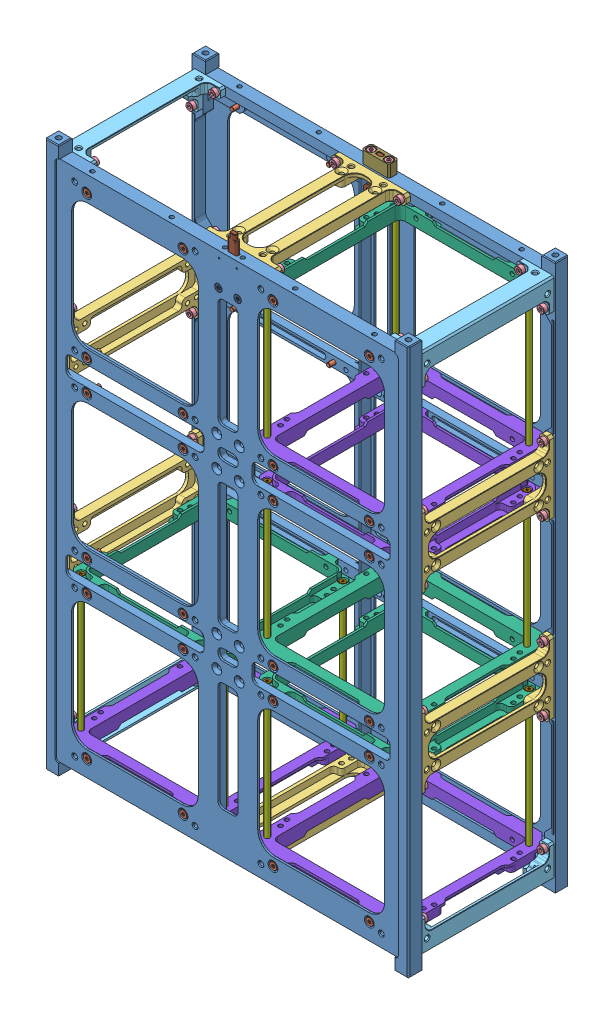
SolidWorks assembly sts-x-6u-cust-ship_asm1.SLDASM, configuration Default (file format 7000). Lengths in mm.
Overall size (226.3 343.75 100).
181 component instances, 12 part files, 0 mates.
Components (placement in the parent):
- SIDE-FRAME-ASM_ASM_1-1: SIDE-FRAME-ASM_ASM_1.sldasm [Default] at (156.4493 196.3138 -10) size (226.3 340.5 9)
  - ISIS-STSX-1-1-001-SIDE-FRAME-RE_1-1: ISIS-STSX-1-1-001-SIDE-FRAME-RE_1.sldprt [Default] at origin size (226.3 340.5 9)
  - M2-5X8_CSK_TORX_1-1: M2-5X8_CSK_TORX_1.sldprt [Default] at (88 -152.5 1.1) x (-1 0 0) z (0 1 0) size (4.7 8 4.7)
  - M2-5X8_CSK_TORX_1-2: M2-5X8_CSK_TORX_1.sldprt [Default] at (28 -152.5 1.1) x (-1 0 0) z (0 1 0) size (4.7 8 4.7)
  - M2-5X8_CSK_TORX_1-3: M2-5X8_CSK_TORX_1.sldprt [Default] at (-28 -152.5 1.1) x (-1 0 0) z (0 1 0) size (4.7 8 4.7)
  - M2-5X8_CSK_TORX_1-4: M2-5X8_CSK_TORX_1.sldprt [Default] at (-88 -152.5 1.1) x (-1 0 0) z (0 1 0) size (4.7 8 4.7)
  - M2-5X8_CSK_TORX_1-5: M2-5X8_CSK_TORX_1.sldprt [Default] at (88 -63.5 1.1) x (-1 0 0) z (0 1 0) size (4.7 8 4.7)
  - M2-5X8_CSK_TORX_1-6: M2-5X8_CSK_TORX_1.sldprt [Default] at (28 -63.5 1.1) x (-1 0 0) z (0 1 0) size (4.7 8 4.7)
  - M2-5X8_CSK_TORX_1-7: M2-5X8_CSK_TORX_1.sldprt [Default] at (-28 -63.5 1.1) x (-1 0 0) z (0 1 0) size (4.7 8 4.7)
  - M2-5X8_CSK_TORX_1-8: M2-5X8_CSK_TORX_1.sldprt [Default] at (-88 -63.5 1.1) x (-1 0 0) z (0 1 0) size (4.7 8 4.7)
  - M2-5X8_CSK_TORX_1-9: M2-5X8_CSK_TORX_1.sldprt [Default] at (88 -44.5 1.1) x (-1 0 0) z (0 1 0) size (4.7 8 4.7)
  - M2-5X8_CSK_TORX_1-10: M2-5X8_CSK_TORX_1.sldprt [Default] at (28 -44.5 1.1) x (-1 0 0) z (0 1 0) size (4.7 8 4.7)
  - M2-5X8_CSK_TORX_1-11: M2-5X8_CSK_TORX_1.sldprt [Default] at (-28 -44.5 1.1) x (-1 0 0) z (0 1 0) size (4.7 8 4.7)
  - M2-5X8_CSK_TORX_1-12: M2-5X8_CSK_TORX_1.sldprt [Default] at (-88 -44.5 1.1) x (-1 0 0) z (0 1 0) size (4.7 8 4.7)
  - M2-5X8_CSK_TORX_1-13: M2-5X8_CSK_TORX_1.sldprt [Default] at (88 44.5 1.1) x (-1 0 0) z (0 1 0) size (4.7 8 4.7)
  - M2-5X8_CSK_TORX_1-14: M2-5X8_CSK_TORX_1.sldprt [Default] at (28 44.5 1.1) x (-1 0 0) z (0 1 0) size (4.7 8 4.7)
  - M2-5X8_CSK_TORX_1-15: M2-5X8_CSK_TORX_1.sldprt [Default] at (-28 44.5 1.1) x (-1 0 0) z (0 1 0) size (4.7 8 4.7)
  - M2-5X8_CSK_TORX_1-16: M2-5X8_CSK_TORX_1.sldprt [Default] at (-88 44.5 1.1) x (-1 0 0) z (0 1 0) size (4.7 8 4.7)
  - M2-5X8_CSK_TORX_1-17: M2-5X8_CSK_TORX_1.sldprt [Default] at (88 63.5 1.1) x (-1 0 0) z (0 1 0) size (4.7 8 4.7)
  - M2-5X8_CSK_TORX_1-18: M2-5X8_CSK_TORX_1.sldprt [Default] at (28 63.5 1.1) x (-1 0 0) z (0 1 0) size (4.7 8 4.7)
  - M2-5X8_CSK_TORX_1-19: M2-5X8_CSK_TORX_1.sldprt [Default] at (-28 63.5 1.1) x (-1 0 0) z (0 1 0) size (4.7 8 4.7)
  - M2-5X8_CSK_TORX_1-20: M2-5X8_CSK_TORX_1.sldprt [Default] at (-88 63.5 1.1) x (-1 0 0) z (0 1 0) size (4.7 8 4.7)
  - M2-5X8_CSK_TORX_1-21: M2-5X8_CSK_TORX_1.sldprt [Default] at (88 152.5 1.1) x (-1 0 0) z (0 1 0) size (4.7 8 4.7)
  - M2-5X8_CSK_TORX_1-22: M2-5X8_CSK_TORX_1.sldprt [Default] at (28 152.5 1.1) x (-1 0 0) z (0 1 0) size (4.7 8 4.7)
  - M2-5X8_CSK_TORX_1-23: M2-5X8_CSK_TORX_1.sldprt [Default] at (-28 152.5 1.1) x (-1 0 0) z (0 1 0) size (4.7 8 4.7)
  - M2-5X8_CSK_TORX_1-24: M2-5X8_CSK_TORX_1.sldprt [Default] at (-88 152.5 1.1) x (-1 0 0) z (0 1 0) size (4.7 8 4.7)
- BRACKET-1-ASM_ASM_1-1: BRACKET-1-ASM_ASM_1.sldasm [Default] at (262.7993 156.3138 -8.5) x (0 -1 0) z (1 0 0) size (46 93 6.01)
  - ISIS-STSX-1-1-002-STRUCTURAL-BR-1: ISIS-STSX-1-1-002-STRUCTURAL-BR.sldprt [Default] at origin size (46 89 6.01)
  - M2-5X8_HEX_1-1: M2-5X8_HEX_1.sldprt [Default] at (34 -5 3) size (4.51 10.5 4.52)
  - M2-5X8_HEX_1-2: M2-5X8_HEX_1.sldprt [Default] at (-6 -5 3) size (4.51 10.5 4.52)
  - M2-5X8_HEX_1-3: M2-5X8_HEX_1.sldprt [Default] at (34 88 3) x (-1 0 0) z (0 0 1) size (4.51 10.5 4.52)
  - M2-5X8_HEX_1-4: M2-5X8_HEX_1.sldprt [Default] at (-6 88 3) x (-1 0 0) z (0 0 1) size (4.51 10.5 4.52)
- BRACKET-1-ASM_ASM_1-2: BRACKET-1-ASM_ASM_1.sldasm [Default] at (262.7993 236.3138 -91.5) x (0 1 0) z (1 0 0) size (46 93 6.01)
  - ISIS-STSX-1-1-002-STRUCTURAL-BR-1: ISIS-STSX-1-1-002-STRUCTURAL-BR.sldprt [Default] at origin size (46 89 6.01)
  - M2-5X8_HEX_1-1: M2-5X8_HEX_1.sldprt [Default] at (34 -5 3) size (4.51 10.5 4.52)
  - M2-5X8_HEX_1-2: M2-5X8_HEX_1.sldprt [Default] at (-6 -5 3) size (4.51 10.5 4.52)
  - M2-5X8_HEX_1-3: M2-5X8_HEX_1.sldprt [Default] at (34 88 3) x (-1 0 0) z (0 0 1) size (4.51 10.5 4.52)
  - M2-5X8_HEX_1-4: M2-5X8_HEX_1.sldprt [Default] at (-6 88 3) x (-1 0 0) z (0 0 1) size (4.51 10.5 4.52)
- BRACKET-1-ASM_ASM_1-3: BRACKET-1-ASM_ASM_1.sldasm [Default] at (50.0993 156.3138 -91.5) x (0 -1 0) z (-1 0 0) size (46 93 6.01)
  - ISIS-STSX-1-1-002-STRUCTURAL-BR-1: ISIS-STSX-1-1-002-STRUCTURAL-BR.sldprt [Default] at origin size (46 89 6.01)
  - M2-5X8_HEX_1-1: M2-5X8_HEX_1.sldprt [Default] at (34 -5 3) size (4.51 10.5 4.52)
  - M2-5X8_HEX_1-2: M2-5X8_HEX_1.sldprt [Default] at (-6 -5 3) size (4.51 10.5 4.52)
  - M2-5X8_HEX_1-3: M2-5X8_HEX_1.sldprt [Default] at (34 88 3) x (-1 0 0) z (0 0 1) size (4.51 10.5 4.52)
  - M2-5X8_HEX_1-4: M2-5X8_HEX_1.sldprt [Default] at (-6 88 3) x (-1 0 0) z (0 0 1) size (4.51 10.5 4.52)
- BRACKET-1-ASM_ASM_1-4: BRACKET-1-ASM_ASM_1.sldasm [Default] at (50.0993 264.3138 -91.5) x (0 -1 0) z (-1 0 0) size (46 93 6.01)
  - ISIS-STSX-1-1-002-STRUCTURAL-BR-1: ISIS-STSX-1-1-002-STRUCTURAL-BR.sldprt [Default] at origin size (46 89 6.01)
  - M2-5X8_HEX_1-1: M2-5X8_HEX_1.sldprt [Default] at (34 -5 3) size (4.51 10.5 4.52)
  - M2-5X8_HEX_1-2: M2-5X8_HEX_1.sldprt [Default] at (-6 -5 3) size (4.51 10.5 4.52)
  - M2-5X8_HEX_1-3: M2-5X8_HEX_1.sldprt [Default] at (34 88 3) x (-1 0 0) z (0 0 1) size (4.51 10.5 4.52)
  - M2-5X8_HEX_1-4: M2-5X8_HEX_1.sldprt [Default] at (-6 88 3) x (-1 0 0) z (0 0 1) size (4.51 10.5 4.52)
- BRACKET-2-ASM_ASM_1-1: BRACKET-2-ASM_ASM_1.sldasm [Default] at (44.0993 359.0138 -91.5) x (0 -1 0) z (0 0 1) size (20 20 93)
  - ISIS-STSX-1-1-003-STRUCTURAL-BR_1-1: ISIS-STSX-1-1-003-STRUCTURAL-BR_1.sldprt [Default] at origin size (20 20 89)
  - M2-5X8_HEX_1-1: M2-5X8_HEX_1.sldprt [Default] at (17 3 88) x (1 0 0) z (0 1 0) size (4.51 10.5 4.52)
  - M2-5X8_HEX_1-2: M2-5X8_HEX_1.sldprt [Default] at (3 17 88) x (1 0 0) z (0 1 0) size (4.51 10.5 4.52)
  - M2-5X8_HEX_1-3: M2-5X8_HEX_1.sldprt [Default] at (17 3 -5) x (-1 0 0) z (0 1 0) size (4.51 10.5 4.52)
  - M2-5X8_HEX_1-4: M2-5X8_HEX_1.sldprt [Default] at (3 17 -5) x (-1 0 0) z (0 1 0) size (4.51 10.5 4.52)
- BRACKET-2-ASM_ASM_1-2: BRACKET-2-ASM_ASM_1.sldasm [Default] at (268.7993 359.0138 -91.5) x (-1 0 0) z (0 0 1) size (20 20 93)
  - ISIS-STSX-1-1-003-STRUCTURAL-BR_1-1: ISIS-STSX-1-1-003-STRUCTURAL-BR_1.sldprt [Default] at origin size (20 20 89)
  - M2-5X8_HEX_1-1: M2-5X8_HEX_1.sldprt [Default] at (17 3 88) x (1 0 0) z (0 1 0) size (4.51 10.5 4.52)
  - M2-5X8_HEX_1-2: M2-5X8_HEX_1.sldprt [Default] at (3 17 88) x (1 0 0) z (0 1 0) size (4.51 10.5 4.52)
  - M2-5X8_HEX_1-3: M2-5X8_HEX_1.sldprt [Default] at (17 3 -5) x (-1 0 0) z (0 1 0) size (4.51 10.5 4.52)
  - M2-5X8_HEX_1-4: M2-5X8_HEX_1.sldprt [Default] at (3 17 -5) x (-1 0 0) z (0 1 0) size (4.51 10.5 4.52)
- BRACKET-2-ASM_ASM_1-3: BRACKET-2-ASM_ASM_1.sldasm [Default] at (44.0993 33.6138 -91.5) size (20 20 93)
  - ISIS-STSX-1-1-003-STRUCTURAL-BR_1-1: ISIS-STSX-1-1-003-STRUCTURAL-BR_1.sldprt [Default] at origin size (20 20 89)
  - M2-5X8_HEX_1-1: M2-5X8_HEX_1.sldprt [Default] at (17 3 88) x (1 0 0) z (0 1 0) size (4.51 10.5 4.52)
  - M2-5X8_HEX_1-2: M2-5X8_HEX_1.sldprt [Default] at (3 17 88) x (1 0 0) z (0 1 0) size (4.51 10.5 4.52)
  - M2-5X8_HEX_1-3: M2-5X8_HEX_1.sldprt [Default] at (17 3 -5) x (-1 0 0) z (0 1 0) size (4.51 10.5 4.52)
  - M2-5X8_HEX_1-4: M2-5X8_HEX_1.sldprt [Default] at (3 17 -5) x (-1 0 0) z (0 1 0) size (4.51 10.5 4.52)
- BRACKET-2-ASM_ASM_1-4: BRACKET-2-ASM_ASM_1.sldasm [Default] at (268.7993 33.6138 -91.5) x (0 1 0) z (0 0 1) size (20 20 93)
  - ISIS-STSX-1-1-003-STRUCTURAL-BR_1-1: ISIS-STSX-1-1-003-STRUCTURAL-BR_1.sldprt [Default] at origin size (20 20 89)
  - M2-5X8_HEX_1-1: M2-5X8_HEX_1.sldprt [Default] at (17 3 88) x (1 0 0) z (0 1 0) size (4.51 10.5 4.52)
  - M2-5X8_HEX_1-2: M2-5X8_HEX_1.sldprt [Default] at (3 17 88) x (1 0 0) z (0 1 0) size (4.51 10.5 4.52)
  - M2-5X8_HEX_1-3: M2-5X8_HEX_1.sldprt [Default] at (17 3 -5) x (-1 0 0) z (0 1 0) size (4.51 10.5 4.52)
  - M2-5X8_HEX_1-4: M2-5X8_HEX_1.sldprt [Default] at (3 17 -5) x (-1 0 0) z (0 1 0) size (4.51 10.5 4.52)
- BRACKET-1-ASM_ASM_1-5: BRACKET-1-ASM_ASM_1.sldasm [Default] at (170.4493 39.6138 -8.5) x (-1 0 0) z (0 -1 0) size (46 93 6.01)
  - ISIS-STSX-1-1-002-STRUCTURAL-BR-1: ISIS-STSX-1-1-002-STRUCTURAL-BR.sldprt [Default] at origin size (46 89 6.01)
  - M2-5X8_HEX_1-1: M2-5X8_HEX_1.sldprt [Default] at (34 -5 3) size (4.51 10.5 4.52)
  - M2-5X8_HEX_1-2: M2-5X8_HEX_1.sldprt [Default] at (-6 -5 3) size (4.51 10.5 4.52)
  - M2-5X8_HEX_1-3: M2-5X8_HEX_1.sldprt [Default] at (34 88 3) x (-1 0 0) z (0 0 1) size (4.51 10.5 4.52)
  - M2-5X8_HEX_1-4: M2-5X8_HEX_1.sldprt [Default] at (-6 88 3) x (-1 0 0) z (0 0 1) size (4.51 10.5 4.52)
- BRACKET-1-ASM_ASM_1-6: BRACKET-1-ASM_ASM_1.sldasm [Default] at (142.4493 353.0138 -8.5) x (1 0 0) z (0 1 0) size (46 93 6.01)
  - ISIS-STSX-1-1-002-STRUCTURAL-BR-1: ISIS-STSX-1-1-002-STRUCTURAL-BR.sldprt [Default] at origin size (46 89 6.01)
  - M2-5X8_HEX_1-1: M2-5X8_HEX_1.sldprt [Default] at (34 -5 3) size (4.51 10.5 4.52)
  - M2-5X8_HEX_1-2: M2-5X8_HEX_1.sldprt [Default] at (-6 -5 3) size (4.51 10.5 4.52)
  - M2-5X8_HEX_1-3: M2-5X8_HEX_1.sldprt [Default] at (34 88 3) x (-1 0 0) z (0 0 1) size (4.51 10.5 4.52)
  - M2-5X8_HEX_1-4: M2-5X8_HEX_1.sldprt [Default] at (-6 88 3) x (-1 0 0) z (0 0 1) size (4.51 10.5 4.52)
- SIDE-FRAME-ASM_ASM_1-2: SIDE-FRAME-ASM_ASM_1.sldasm [Default] at (156.4493 196.3138 -90) x (-1 0 0) z (0 0 -1) size (226.3 340.5 9)
  - ISIS-STSX-1-1-001-SIDE-FRAME-RE_1-1: ISIS-STSX-1-1-001-SIDE-FRAME-RE_1.sldprt [Default] at origin size (226.3 340.5 9)
  - M2-5X8_CSK_TORX_1-1: M2-5X8_CSK_TORX_1.sldprt [Default] at (88 -152.5 1.1) x (-1 0 0) z (0 1 0) size (4.7 8 4.7)
  - M2-5X8_CSK_TORX_1-2: M2-5X8_CSK_TORX_1.sldprt [Default] at (28 -152.5 1.1) x (-1 0 0) z (0 1 0) size (4.7 8 4.7)
  - M2-5X8_CSK_TORX_1-3: M2-5X8_CSK_TORX_1.sldprt [Default] at (-28 -152.5 1.1) x (-1 0 0) z (0 1 0) size (4.7 8 4.7)
  - M2-5X8_CSK_TORX_1-4: M2-5X8_CSK_TORX_1.sldprt [Default] at (-88 -152.5 1.1) x (-1 0 0) z (0 1 0) size (4.7 8 4.7)
  - M2-5X8_CSK_TORX_1-5: M2-5X8_CSK_TORX_1.sldprt [Default] at (88 -63.5 1.1) x (-1 0 0) z (0 1 0) size (4.7 8 4.7)
  - M2-5X8_CSK_TORX_1-6: M2-5X8_CSK_TORX_1.sldprt [Default] at (28 -63.5 1.1) x (-1 0 0) z (0 1 0) size (4.7 8 4.7)
  - M2-5X8_CSK_TORX_1-7: M2-5X8_CSK_TORX_1.sldprt [Default] at (-28 -63.5 1.1) x (-1 0 0) z (0 1 0) size (4.7 8 4.7)
  - M2-5X8_CSK_TORX_1-8: M2-5X8_CSK_TORX_1.sldprt [Default] at (-88 -63.5 1.1) x (-1 0 0) z (0 1 0) size (4.7 8 4.7)
  - M2-5X8_CSK_TORX_1-9: M2-5X8_CSK_TORX_1.sldprt [Default] at (88 -44.5 1.1) x (-1 0 0) z (0 1 0) size (4.7 8 4.7)
  - M2-5X8_CSK_TORX_1-10: M2-5X8_CSK_TORX_1.sldprt [Default] at (28 -44.5 1.1) x (-1 0 0) z (0 1 0) size (4.7 8 4.7)
  - M2-5X8_CSK_TORX_1-11: M2-5X8_CSK_TORX_1.sldprt [Default] at (-28 -44.5 1.1) x (-1 0 0) z (0 1 0) size (4.7 8 4.7)
  - M2-5X8_CSK_TORX_1-12: M2-5X8_CSK_TORX_1.sldprt [Default] at (-88 -44.5 1.1) x (-1 0 0) z (0 1 0) size (4.7 8 4.7)
  - M2-5X8_CSK_TORX_1-13: M2-5X8_CSK_TORX_1.sldprt [Default] at (88 44.5 1.1) x (-1 0 0) z (0 1 0) size (4.7 8 4.7)
  - M2-5X8_CSK_TORX_1-14: M2-5X8_CSK_TORX_1.sldprt [Default] at (28 44.5 1.1) x (-1 0 0) z (0 1 0) size (4.7 8 4.7)
  - M2-5X8_CSK_TORX_1-15: M2-5X8_CSK_TORX_1.sldprt [Default] at (-28 44.5 1.1) x (-1 0 0) z (0 1 0) size (4.7 8 4.7)
  - M2-5X8_CSK_TORX_1-16: M2-5X8_CSK_TORX_1.sldprt [Default] at (-88 44.5 1.1) x (-1 0 0) z (0 1 0) size (4.7 8 4.7)
  - M2-5X8_CSK_TORX_1-17: M2-5X8_CSK_TORX_1.sldprt [Default] at (88 63.5 1.1) x (-1 0 0) z (0 1 0) size (4.7 8 4.7)
  - M2-5X8_CSK_TORX_1-18: M2-5X8_CSK_TORX_1.sldprt [Default] at (28 63.5 1.1) x (-1 0 0) z (0 1 0) size (4.7 8 4.7)
  - M2-5X8_CSK_TORX_1-19: M2-5X8_CSK_TORX_1.sldprt [Default] at (-28 63.5 1.1) x (-1 0 0) z (0 1 0) size (4.7 8 4.7)
  - M2-5X8_CSK_TORX_1-20: M2-5X8_CSK_TORX_1.sldprt [Default] at (-88 63.5 1.1) x (-1 0 0) z (0 1 0) size (4.7 8 4.7)
  - M2-5X8_CSK_TORX_1-21: M2-5X8_CSK_TORX_1.sldprt [Default] at (88 152.5 1.1) x (-1 0 0) z (0 1 0) size (4.7 8 4.7)
  - M2-5X8_CSK_TORX_1-22: M2-5X8_CSK_TORX_1.sldprt [Default] at (28 152.5 1.1) x (-1 0 0) z (0 1 0) size (4.7 8 4.7)
  - M2-5X8_CSK_TORX_1-23: M2-5X8_CSK_TORX_1.sldprt [Default] at (-28 152.5 1.1) x (-1 0 0) z (0 1 0) size (4.7 8 4.7)
  - M2-5X8_CSK_TORX_1-24: M2-5X8_CSK_TORX_1.sldprt [Default] at (-88 152.5 1.1) x (-1 0 0) z (0 1 0) size (4.7 8 4.7)
- STACK-FRAME_ASM_1-1: STACK-FRAME_ASM_1.sldasm [Default] at (214.4493 136.3138 -50) x (1 0 0) z (0 -1 0) size (95.83 95.82 95.81)
  - ISIS-STSX-1-2-001-STACK-FRAME-A_1-1: ISIS-STSX-1-2-001-STACK-FRAME-A_1.sldprt [Default] at origin size (95.83 95.82 8.41)
  - ISIS-STSX-1-2-003-STACK-ROD-1U-_1-1: ISIS-STSX-1-2-003-STACK-ROD-1U-_1.sldprt [Default] at (-42.8 39.95 5.5) size (3.1 3.1 85)
  - ISIS-STSX-1-2-003-STACK-ROD-1U-_1-2: ISIS-STSX-1-2-003-STACK-ROD-1U-_1.sldprt [Default] at (42.9 36.15 5.5) size (3.1 3.1 85)
  - ISIS-STSX-1-2-003-STACK-ROD-1U-_1-3: ISIS-STSX-1-2-003-STACK-ROD-1U-_1.sldprt [Default] at (42.9 -37.45 5.5) size (3.1 3.1 85)
  - ISIS-STSX-1-2-003-STACK-ROD-1U-_1-4: ISIS-STSX-1-2-003-STACK-ROD-1U-_1.sldprt [Default] at (-42.8 -39.95 5.5) size (3.1 3.1 85)
  - ISIS-STSX-1-2-002-STACK-FRAME-B_1-1: ISIS-STSX-1-2-002-STACK-FRAME-B_1.sldprt [Default] at (0 0 96) x (1 0 0) z (0 0 -1) size (95.83 95.82 8.41)
  - M2-0X6_CSK_TORX_1-1: M2-0X6_CSK_TORX_1.sldprt [Default] at (42.9 -37.45 86.4) x (-1 0 0) z (0 1 0) size (3.8 6 3.8)
  - M2-0X6_CSK_TORX_1-2: M2-0X6_CSK_TORX_1.sldprt [Default] at (42.9 36.15 86.4) x (-1 0 0) z (0 1 0) size (3.8 6 3.8)
  - M2-0X6_CSK_TORX_1-3: M2-0X6_CSK_TORX_1.sldprt [Default] at (-42.8 -39.95 86.4) x (-1 0 0) z (0 1 0) size (3.8 6 3.8)
  - M2-0X6_CSK_TORX_1-4: M2-0X6_CSK_TORX_1.sldprt [Default] at (-42.8 39.95 86.4) x (-1 0 0) z (0 1 0) size (3.8 6 3.8)
  - M2-0X6_CSK_TORX_1-5: M2-0X6_CSK_TORX_1.sldprt [Default] at (42.9 -37.45 9.6) x (1 0 0) z (0 1 0) size (3.8 6 3.8)
  - M2-0X6_CSK_TORX_1-6: M2-0X6_CSK_TORX_1.sldprt [Default] at (42.9 36.15 9.6) x (1 0 0) z (0 1 0) size (3.8 6 3.8)
  - M2-0X6_CSK_TORX_1-7: M2-0X6_CSK_TORX_1.sldprt [Default] at (-42.8 -39.95 9.6) x (1 0 0) z (0 1 0) size (3.8 6 3.8)
  - M2-0X6_CSK_TORX_1-8: M2-0X6_CSK_TORX_1.sldprt [Default] at (-42.8 39.95 9.6) x (1 0 0) z (0 1 0) size (3.8 6 3.8)
- STACK-FRAME_ASM_1-2: STACK-FRAME_ASM_1.sldasm [Default] at (214.4493 148.3138 -50) x (1 0 0) z (0 1 0) size (95.83 95.82 95.81)
  - ISIS-STSX-1-2-001-STACK-FRAME-A_1-1: ISIS-STSX-1-2-001-STACK-FRAME-A_1.sldprt [Default] at origin size (95.83 95.82 8.41)
  - ISIS-STSX-1-2-003-STACK-ROD-1U-_1-1: ISIS-STSX-1-2-003-STACK-ROD-1U-_1.sldprt [Default] at (-42.8 39.95 5.5) size (3.1 3.1 85)
  - ISIS-STSX-1-2-003-STACK-ROD-1U-_1-2: ISIS-STSX-1-2-003-STACK-ROD-1U-_1.sldprt [Default] at (42.9 36.15 5.5) size (3.1 3.1 85)
  - ISIS-STSX-1-2-003-STACK-ROD-1U-_1-3: ISIS-STSX-1-2-003-STACK-ROD-1U-_1.sldprt [Default] at (42.9 -37.45 5.5) size (3.1 3.1 85)
  - ISIS-STSX-1-2-003-STACK-ROD-1U-_1-4: ISIS-STSX-1-2-003-STACK-ROD-1U-_1.sldprt [Default] at (-42.8 -39.95 5.5) size (3.1 3.1 85)
  - ISIS-STSX-1-2-002-STACK-FRAME-B_1-1: ISIS-STSX-1-2-002-STACK-FRAME-B_1.sldprt [Default] at (0 0 96) x (1 0 0) z (0 0 -1) size (95.83 95.82 8.41)
  - M2-0X6_CSK_TORX_1-1: M2-0X6_CSK_TORX_1.sldprt [Default] at (42.9 -37.45 86.4) x (-1 0 0) z (0 1 0) size (3.8 6 3.8)
  - M2-0X6_CSK_TORX_1-2: M2-0X6_CSK_TORX_1.sldprt [Default] at (42.9 36.15 86.4) x (-1 0 0) z (0 1 0) size (3.8 6 3.8)
  - M2-0X6_CSK_TORX_1-3: M2-0X6_CSK_TORX_1.sldprt [Default] at (-42.8 -39.95 86.4) x (-1 0 0) z (0 1 0) size (3.8 6 3.8)
  - M2-0X6_CSK_TORX_1-4: M2-0X6_CSK_TORX_1.sldprt [Default] at (-42.8 39.95 86.4) x (-1 0 0) z (0 1 0) size (3.8 6 3.8)
  - M2-0X6_CSK_TORX_1-5: M2-0X6_CSK_TORX_1.sldprt [Default] at (42.9 -37.45 9.6) x (1 0 0) z (0 1 0) size (3.8 6 3.8)
  - M2-0X6_CSK_TORX_1-6: M2-0X6_CSK_TORX_1.sldprt [Default] at (42.9 36.15 9.6) x (1 0 0) z (0 1 0) size (3.8 6 3.8)
  - M2-0X6_CSK_TORX_1-7: M2-0X6_CSK_TORX_1.sldprt [Default] at (-42.8 -39.95 9.6) x (1 0 0) z (0 1 0) size (3.8 6 3.8)
  - M2-0X6_CSK_TORX_1-8: M2-0X6_CSK_TORX_1.sldprt [Default] at (-42.8 39.95 9.6) x (1 0 0) z (0 1 0) size (3.8 6 3.8)
- STACK-FRAME_ASM_1-3: STACK-FRAME_ASM_1.sldasm [Default] at (214.4493 352.3138 -50) x (1 0 0) z (0 -1 0) size (95.83 95.82 95.81)
  - ISIS-STSX-1-2-001-STACK-FRAME-A_1-1: ISIS-STSX-1-2-001-STACK-FRAME-A_1.sldprt [Default] at origin size (95.83 95.82 8.41)
  - ISIS-STSX-1-2-003-STACK-ROD-1U-_1-1: ISIS-STSX-1-2-003-STACK-ROD-1U-_1.sldprt [Default] at (-42.8 39.95 5.5) size (3.1 3.1 85)
  - ISIS-STSX-1-2-003-STACK-ROD-1U-_1-2: ISIS-STSX-1-2-003-STACK-ROD-1U-_1.sldprt [Default] at (42.9 36.15 5.5) size (3.1 3.1 85)
  - ISIS-STSX-1-2-003-STACK-ROD-1U-_1-3: ISIS-STSX-1-2-003-STACK-ROD-1U-_1.sldprt [Default] at (42.9 -37.45 5.5) size (3.1 3.1 85)
  - ISIS-STSX-1-2-003-STACK-ROD-1U-_1-4: ISIS-STSX-1-2-003-STACK-ROD-1U-_1.sldprt [Default] at (-42.8 -39.95 5.5) size (3.1 3.1 85)
  - ISIS-STSX-1-2-002-STACK-FRAME-B_1-1: ISIS-STSX-1-2-002-STACK-FRAME-B_1.sldprt [Default] at (0 0 96) x (1 0 0) z (0 0 -1) size (95.83 95.82 8.41)
  - M2-0X6_CSK_TORX_1-1: M2-0X6_CSK_TORX_1.sldprt [Default] at (42.9 -37.45 86.4) x (-1 0 0) z (0 1 0) size (3.8 6 3.8)
  - M2-0X6_CSK_TORX_1-2: M2-0X6_CSK_TORX_1.sldprt [Default] at (42.9 36.15 86.4) x (-1 0 0) z (0 1 0) size (3.8 6 3.8)
  - M2-0X6_CSK_TORX_1-3: M2-0X6_CSK_TORX_1.sldprt [Default] at (-42.8 -39.95 86.4) x (-1 0 0) z (0 1 0) size (3.8 6 3.8)
  - M2-0X6_CSK_TORX_1-4: M2-0X6_CSK_TORX_1.sldprt [Default] at (-42.8 39.95 86.4) x (-1 0 0) z (0 1 0) size (3.8 6 3.8)
  - M2-0X6_CSK_TORX_1-5: M2-0X6_CSK_TORX_1.sldprt [Default] at (42.9 -37.45 9.6) x (1 0 0) z (0 1 0) size (3.8 6 3.8)
  - M2-0X6_CSK_TORX_1-6: M2-0X6_CSK_TORX_1.sldprt [Default] at (42.9 36.15 9.6) x (1 0 0) z (0 1 0) size (3.8 6 3.8)
  - M2-0X6_CSK_TORX_1-7: M2-0X6_CSK_TORX_1.sldprt [Default] at (-42.8 -39.95 9.6) x (1 0 0) z (0 1 0) size (3.8 6 3.8)
  - M2-0X6_CSK_TORX_1-8: M2-0X6_CSK_TORX_1.sldprt [Default] at (-42.8 39.95 9.6) x (1 0 0) z (0 1 0) size (3.8 6 3.8)
- STACK-FRAME_ASM_1-4: STACK-FRAME_ASM_1.sldasm [Default] at (98.4493 136.3138 -50) x (1 0 0) z (0 -1 0) size (95.83 95.82 95.81)
  - ISIS-STSX-1-2-001-STACK-FRAME-A_1-1: ISIS-STSX-1-2-001-STACK-FRAME-A_1.sldprt [Default] at origin size (95.83 95.82 8.41)
  - ISIS-STSX-1-2-003-STACK-ROD-1U-_1-1: ISIS-STSX-1-2-003-STACK-ROD-1U-_1.sldprt [Default] at (-42.8 39.95 5.5) size (3.1 3.1 85)
  - ISIS-STSX-1-2-003-STACK-ROD-1U-_1-2: ISIS-STSX-1-2-003-STACK-ROD-1U-_1.sldprt [Default] at (42.9 36.15 5.5) size (3.1 3.1 85)
  - ISIS-STSX-1-2-003-STACK-ROD-1U-_1-3: ISIS-STSX-1-2-003-STACK-ROD-1U-_1.sldprt [Default] at (42.9 -37.45 5.5) size (3.1 3.1 85)
  - ISIS-STSX-1-2-003-STACK-ROD-1U-_1-4: ISIS-STSX-1-2-003-STACK-ROD-1U-_1.sldprt [Default] at (-42.8 -39.95 5.5) size (3.1 3.1 85)
  - ISIS-STSX-1-2-002-STACK-FRAME-B_1-1: ISIS-STSX-1-2-002-STACK-FRAME-B_1.sldprt [Default] at (0 0 96) x (1 0 0) z (0 0 -1) size (95.83 95.82 8.41)
  - M2-0X6_CSK_TORX_1-1: M2-0X6_CSK_TORX_1.sldprt [Default] at (42.9 -37.45 86.4) x (-1 0 0) z (0 1 0) size (3.8 6 3.8)
  - M2-0X6_CSK_TORX_1-2: M2-0X6_CSK_TORX_1.sldprt [Default] at (42.9 36.15 86.4) x (-1 0 0) z (0 1 0) size (3.8 6 3.8)
  - M2-0X6_CSK_TORX_1-3: M2-0X6_CSK_TORX_1.sldprt [Default] at (-42.8 -39.95 86.4) x (-1 0 0) z (0 1 0) size (3.8 6 3.8)
  - M2-0X6_CSK_TORX_1-4: M2-0X6_CSK_TORX_1.sldprt [Default] at (-42.8 39.95 86.4) x (-1 0 0) z (0 1 0) size (3.8 6 3.8)
  - M2-0X6_CSK_TORX_1-5: M2-0X6_CSK_TORX_1.sldprt [Default] at (42.9 -37.45 9.6) x (1 0 0) z (0 1 0) size (3.8 6 3.8)
  - M2-0X6_CSK_TORX_1-6: M2-0X6_CSK_TORX_1.sldprt [Default] at (42.9 36.15 9.6) x (1 0 0) z (0 1 0) size (3.8 6 3.8)
  - M2-0X6_CSK_TORX_1-7: M2-0X6_CSK_TORX_1.sldprt [Default] at (-42.8 -39.95 9.6) x (1 0 0) z (0 1 0) size (3.8 6 3.8)
  - M2-0X6_CSK_TORX_1-8: M2-0X6_CSK_TORX_1.sldprt [Default] at (-42.8 39.95 9.6) x (1 0 0) z (0 1 0) size (3.8 6 3.8)
- M2-5X6_CSK_TORX_1-1: M2-5X6_CSK_TORX_1.sldprt [Default] at (162.4493 338.8138 -6.8) x (-1 0 0) z (0 1 0) size (4.71 6 4.7)
- M2-5X6_CSK_TORX_1-2: M2-5X6_CSK_TORX_1.sldprt [Default] at (150.4493 338.8138 -6.8) x (-1 0 0) z (0 1 0) size (4.71 6 4.7)
- M2-5X6_CSK_TORX_1-3: M2-5X6_CSK_TORX_1.sldprt [Default] at (150.4493 338.8138 -93.2) x (1 0 0) z (0 1 0) size (4.71 6 4.7)
- M2-5X6_CSK_TORX_1-4: M2-5X6_CSK_TORX_1.sldprt [Default] at (162.4493 338.8138 -93.2) x (1 0 0) z (0 1 0) size (4.71 6 4.7)
- ISIS-STSX-1-1-004-PLUNGER-REVA_1-1: ISIS-STSX-1-1-004-PLUNGER-REVA_1.sldprt [Default] at (156.4493 343.8138 -95.5) x (1 0 0) z (0 1 0) size (16.01 4.7 22.5)
- ISIS-STSX-1-1-004-PLUNGER-REVA_1-2: ISIS-STSX-1-1-004-PLUNGER-REVA_1.sldprt [Default] at (156.4493 347.3138 -4.5) x (1 0 0) z (0 1 0) size (16.01 4.7 22.5)
- ISIS-STSX-1-1-006-KILL-SWITCH-C_1-1: ISIS-STSX-1-1-006-KILL-SWITCH-C_1.sldprt [Default] at (156.4493 366.5638 -95.5) x (1 0 0) z (0 -1 0) size (17 6 7.55)
- M2-5X8_HEX_1-1: M2-5X8_HEX_1.sldprt [Default] at (150.9493 355.8138 -95.5) size (4.51 10.5 4.52)
- M2-5X8_HEX_1-2: M2-5X8_HEX_1.sldprt [Default] at (161.9493 355.8138 -95.5) size (4.51 10.5 4.52)
